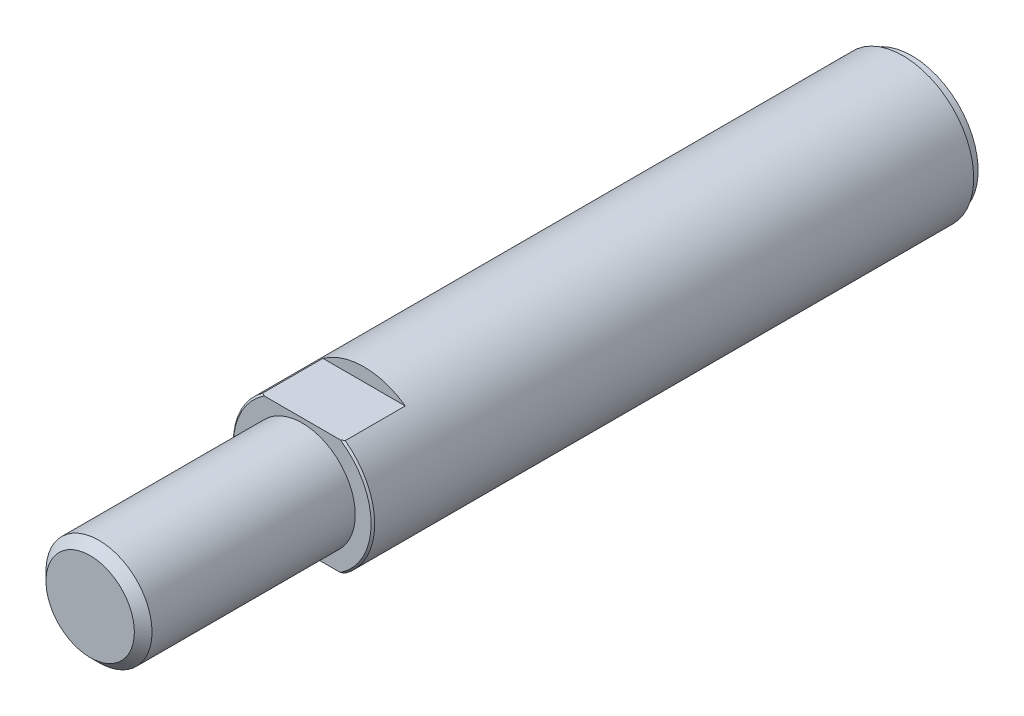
ISO-10303-21;
HEADER;
FILE_DESCRIPTION(('STEP AP214'),'2;1');
FILE_NAME('part.step','',(''),(''),'','','');
FILE_SCHEMA(('AUTOMOTIVE_DESIGN { 1 0 10303 214 1 1 1 1 }'));
ENDSEC;
DATA;
#1=APPLICATION_CONTEXT('core data for automotive mechanical design processes');
#2=APPLICATION_PROTOCOL_DEFINITION('international standard','automotive_design',2000,#1);
#3=PRODUCT_CONTEXT('',#1,'mechanical');
#4=PRODUCT('Part','Part','',(#3));
#5=PRODUCT_RELATED_PRODUCT_CATEGORY('part','',(#4));
#6=PRODUCT_DEFINITION_FORMATION('','',#4);
#7=PRODUCT_DEFINITION_CONTEXT('part definition',#1,'design');
#8=PRODUCT_DEFINITION('design','',#6,#7);
#9=PRODUCT_DEFINITION_SHAPE('','',#8);
#10=(LENGTH_UNIT() NAMED_UNIT(*) SI_UNIT(.MILLI.,.METRE.));
#11=(NAMED_UNIT(*) PLANE_ANGLE_UNIT() SI_UNIT($,.RADIAN.));
#12=(NAMED_UNIT(*) SI_UNIT($,.STERADIAN.) SOLID_ANGLE_UNIT());
#13=UNCERTAINTY_MEASURE_WITH_UNIT(LENGTH_MEASURE(1.E-05),#10,'distance_accuracy_value','');
#14=(GEOMETRIC_REPRESENTATION_CONTEXT(3) GLOBAL_UNCERTAINTY_ASSIGNED_CONTEXT((#13)) GLOBAL_UNIT_ASSIGNED_CONTEXT((#10,
#11,#12)) REPRESENTATION_CONTEXT('',''));
#15=CARTESIAN_POINT('',(0.,0.,0.));
#16=DIRECTION('',(0.,0.,1.));
#17=DIRECTION('',(1.,0.,0.));
#18=AXIS2_PLACEMENT_3D('',#15,#16,#17);
#19=CARTESIAN_POINT('',(0.,0.,93.));
#20=DIRECTION('',(0.,0.,-1.));
#21=DIRECTION('',(-1.,0.,0.));
#22=AXIS2_PLACEMENT_3D('',#19,#20,#21);
#23=CYLINDRICAL_SURFACE('',#22,8.);
#24=DIRECTION('',(0.,0.,-1.));
#25=VECTOR('',#24,1.);
#26=CARTESIAN_POINT('',(-4.66368952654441,-6.5,93.));
#27=LINE('',#26,#25);
#28=CARTESIAN_POINT('',(-4.66368952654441,-6.5,68.8));
#29=VERTEX_POINT('',#28);
#30=CARTESIAN_POINT('',(-4.66368952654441,-6.5,62.));
#31=VERTEX_POINT('',#30);
#32=EDGE_CURVE('E337',#29,#31,#27,.T.);
#33=ORIENTED_EDGE('',*,*,#32,.F.);
#34=CARTESIAN_POINT('',(0.,0.,68.8));
#35=DIRECTION('',(0.,0.,1.));
#36=DIRECTION('',(1.,0.,0.));
#37=AXIS2_PLACEMENT_3D('',#34,#35,#36);
#38=CIRCLE('',#37,8.);
#39=CARTESIAN_POINT('',(-4.66368952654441,6.5,68.8));
#40=VERTEX_POINT('',#39);
#41=EDGE_CURVE('E66',#29,#40,#38,.F.);
#42=ORIENTED_EDGE('',*,*,#41,.T.);
#43=DIRECTION('',(0.,0.,-1.));
#44=VECTOR('',#43,1.);
#45=CARTESIAN_POINT('',(-4.66368952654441,6.5,93.));
#46=LINE('',#45,#44);
#47=CARTESIAN_POINT('',(-4.66368952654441,6.5,62.));
#48=VERTEX_POINT('',#47);
#49=EDGE_CURVE('E106',#48,#40,#46,.F.);
#50=ORIENTED_EDGE('',*,*,#49,.F.);
#51=CARTESIAN_POINT('',(0.,0.,62.));
#52=DIRECTION('',(0.,0.,1.));
#53=DIRECTION('',(1.,0.,0.));
#54=AXIS2_PLACEMENT_3D('',#51,#52,#53);
#55=CIRCLE('',#54,8.);
#56=CARTESIAN_POINT('',(4.66368952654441,6.5,62.));
#57=VERTEX_POINT('',#56);
#58=EDGE_CURVE('E110',#57,#48,#55,.T.);
#59=ORIENTED_EDGE('',*,*,#58,.F.);
#60=DIRECTION('',(0.,0.,-1.));
#61=VECTOR('',#60,1.);
#62=CARTESIAN_POINT('',(4.66368952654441,6.5,93.));
#63=LINE('',#62,#61);
#64=CARTESIAN_POINT('',(4.66368952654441,6.5,68.8));
#65=VERTEX_POINT('',#64);
#66=EDGE_CURVE('E99',#65,#57,#63,.T.);
#67=ORIENTED_EDGE('',*,*,#66,.F.);
#68=CARTESIAN_POINT('',(0.,0.,68.8));
#69=DIRECTION('',(0.,0.,1.));
#70=DIRECTION('',(1.,0.,0.));
#71=AXIS2_PLACEMENT_3D('',#68,#69,#70);
#72=CIRCLE('',#71,8.);
#73=CARTESIAN_POINT('',(4.66368952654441,-6.5,68.8));
#74=VERTEX_POINT('',#73);
#75=EDGE_CURVE('E353',#65,#74,#72,.F.);
#76=ORIENTED_EDGE('',*,*,#75,.T.);
#77=DIRECTION('',(0.,0.,-1.));
#78=VECTOR('',#77,1.);
#79=CARTESIAN_POINT('',(4.66368952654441,-6.5,93.));
#80=LINE('',#79,#78);
#81=CARTESIAN_POINT('',(4.66368952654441,-6.5,62.));
#82=VERTEX_POINT('',#81);
#83=EDGE_CURVE('E105',#82,#74,#80,.F.);
#84=ORIENTED_EDGE('',*,*,#83,.F.);
#85=EDGE_CURVE('E114',#31,#82,#55,.T.);
#86=ORIENTED_EDGE('',*,*,#85,.F.);
#87=EDGE_LOOP('',(#33,#42,#50,#59,#67,#76,#84,#86));
#88=FACE_BOUND('',#87,.T.);
#89=CARTESIAN_POINT('',(0.,0.,1.));
#90=DIRECTION('',(0.,0.,-1.));
#91=DIRECTION('',(-1.,0.,0.));
#92=AXIS2_PLACEMENT_3D('',#89,#90,#91);
#93=CIRCLE('',#92,8.);
#94=CARTESIAN_POINT('',(-8.,0.,1.));
#95=VERTEX_POINT('',#94);
#96=EDGE_CURVE('E46',#95,#95,#93,.T.);
#97=ORIENTED_EDGE('',*,*,#96,.F.);
#98=EDGE_LOOP('',(#97));
#99=FACE_BOUND('',#98,.T.);
#100=ADVANCED_FACE('F42',(#88,#99),#23,.T.);
#101=CARTESIAN_POINT('',(0.,0.,69.));
#102=DIRECTION('',(0.,0.,1.));
#103=DIRECTION('',(1.,0.,0.));
#104=AXIS2_PLACEMENT_3D('',#101,#102,#103);
#105=PLANE('',#104);
#106=CARTESIAN_POINT('',(0.,0.,69.));
#107=DIRECTION('',(0.,0.,1.));
#108=DIRECTION('',(1.,0.,0.));
#109=AXIS2_PLACEMENT_3D('',#106,#107,#108);
#110=CIRCLE('',#109,6.);
#111=CARTESIAN_POINT('',(6.,0.,69.));
#112=VERTEX_POINT('',#111);
#113=EDGE_CURVE('E345',#112,#112,#110,.T.);
#114=ORIENTED_EDGE('',*,*,#113,.F.);
#115=EDGE_LOOP('',(#114));
#116=FACE_BOUND('',#115,.T.);
#117=DIRECTION('',(-1.,0.,0.));
#118=VECTOR('',#117,1.);
#119=CARTESIAN_POINT('',(0.,6.5,69.));
#120=LINE('',#119,#118);
#121=CARTESIAN_POINT('',(4.31161222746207,6.5,69.));
#122=VERTEX_POINT('',#121);
#123=CARTESIAN_POINT('',(-4.31161222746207,6.5,69.));
#124=VERTEX_POINT('',#123);
#125=EDGE_CURVE('E119',#122,#124,#120,.T.);
#126=ORIENTED_EDGE('',*,*,#125,.T.);
#127=CARTESIAN_POINT('',(0.,0.,69.));
#128=DIRECTION('',(0.,0.,1.));
#129=DIRECTION('',(1.,0.,0.));
#130=AXIS2_PLACEMENT_3D('',#127,#128,#129);
#131=CIRCLE('',#130,7.80000000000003);
#132=CARTESIAN_POINT('',(-4.31161222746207,-6.5,69.));
#133=VERTEX_POINT('',#132);
#134=EDGE_CURVE('E125',#124,#133,#131,.T.);
#135=ORIENTED_EDGE('',*,*,#134,.T.);
#136=DIRECTION('',(1.,0.,0.));
#137=VECTOR('',#136,1.);
#138=CARTESIAN_POINT('',(0.,-6.5,69.));
#139=LINE('',#138,#137);
#140=CARTESIAN_POINT('',(4.31161222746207,-6.5,69.));
#141=VERTEX_POINT('',#140);
#142=EDGE_CURVE('E115',#133,#141,#139,.T.);
#143=ORIENTED_EDGE('',*,*,#142,.T.);
#144=CARTESIAN_POINT('',(0.,0.,69.));
#145=DIRECTION('',(0.,0.,1.));
#146=DIRECTION('',(1.,0.,0.));
#147=AXIS2_PLACEMENT_3D('',#144,#145,#146);
#148=CIRCLE('',#147,7.80000000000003);
#149=EDGE_CURVE('E117',#141,#122,#148,.T.);
#150=ORIENTED_EDGE('',*,*,#149,.T.);
#151=EDGE_LOOP('',(#126,#135,#143,#150));
#152=FACE_BOUND('',#151,.T.);
#153=ADVANCED_FACE('F188',(#116,#152),#105,.T.);
#154=CARTESIAN_POINT('',(0.,0.,69.));
#155=DIRECTION('',(0.,0.,1.));
#156=DIRECTION('',(1.,0.,0.));
#157=AXIS2_PLACEMENT_3D('',#154,#155,#156);
#158=CYLINDRICAL_SURFACE('',#157,6.);
#159=CARTESIAN_POINT('',(0.,0.,92.));
#160=DIRECTION('',(0.,0.,1.));
#161=DIRECTION('',(1.,0.,0.));
#162=AXIS2_PLACEMENT_3D('',#159,#160,#161);
#163=CIRCLE('',#162,6.);
#164=CARTESIAN_POINT('',(6.,0.,92.));
#165=VERTEX_POINT('',#164);
#166=EDGE_CURVE('E12',#165,#165,#163,.F.);
#167=ORIENTED_EDGE('',*,*,#166,.T.);
#168=EDGE_LOOP('',(#167));
#169=FACE_BOUND('',#168,.T.);
#170=ORIENTED_EDGE('',*,*,#113,.T.);
#171=EDGE_LOOP('',(#170));
#172=FACE_BOUND('',#171,.T.);
#173=ADVANCED_FACE('F185',(#169,#172),#158,.T.);
#174=CARTESIAN_POINT('',(0.,0.,93.));
#175=DIRECTION('',(0.,0.,1.));
#176=DIRECTION('',(1.,0.,0.));
#177=AXIS2_PLACEMENT_3D('',#174,#175,#176);
#178=PLANE('',#177);
#179=CARTESIAN_POINT('',(0.,0.,93.));
#180=DIRECTION('',(0.,0.,1.));
#181=DIRECTION('',(1.,0.,0.));
#182=AXIS2_PLACEMENT_3D('',#179,#180,#181);
#183=CIRCLE('',#182,4.99999999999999);
#184=CARTESIAN_POINT('',(4.99999999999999,0.,93.));
#185=VERTEX_POINT('',#184);
#186=EDGE_CURVE('E51',#185,#185,#183,.T.);
#187=ORIENTED_EDGE('',*,*,#186,.T.);
#188=EDGE_LOOP('',(#187));
#189=FACE_BOUND('',#188,.T.);
#190=ADVANCED_FACE('F170',(#189),#178,.T.);
#191=CARTESIAN_POINT('',(-13.7678185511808,6.5,62.));
#192=DIRECTION('',(0.,1.,0.));
#193=DIRECTION('',(0.,0.,1.));
#194=AXIS2_PLACEMENT_3D('',#191,#192,#193);
#195=PLANE('',#194);
#196=ORIENTED_EDGE('',*,*,#49,.T.);
#197=CARTESIAN_POINT('',(-4.66368952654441,6.5,68.8));
#198=CARTESIAN_POINT('',(-4.60539036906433,6.5,68.8340029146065));
#199=CARTESIAN_POINT('',(-4.5469010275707,6.5,68.8676710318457));
#200=CARTESIAN_POINT('',(-4.4295419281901,6.5,68.9343376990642));
#201=CARTESIAN_POINT('',(-4.37067216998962,6.5,68.9673362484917));
#202=CARTESIAN_POINT('',(-4.31161222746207,6.5,69.));
#203=B_SPLINE_CURVE_WITH_KNOTS('',3,(#197,#198,#199,#200,#201,#202),.UNSPECIFIED.,.F.,.F.,(4,2,
4),(0.,0.202462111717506,0.404924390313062),.UNSPECIFIED.);
#204=EDGE_CURVE('E161',#40,#124,#203,.T.);
#205=ORIENTED_EDGE('',*,*,#204,.T.);
#206=ORIENTED_EDGE('',*,*,#125,.F.);
#207=CARTESIAN_POINT('',(4.31161222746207,6.5,69.));
#208=CARTESIAN_POINT('',(4.37067216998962,6.5,68.9673362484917));
#209=CARTESIAN_POINT('',(4.4295419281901,6.5,68.9343376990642));
#210=CARTESIAN_POINT('',(4.5469010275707,6.5,68.8676710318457));
#211=CARTESIAN_POINT('',(4.60539036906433,6.5,68.8340029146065));
#212=CARTESIAN_POINT('',(4.66368952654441,6.5,68.8));
#213=B_SPLINE_CURVE_WITH_KNOTS('',3,(#207,#208,#209,#210,#211,#212),.UNSPECIFIED.,.F.,.F.,(4,2,
4),(0.,0.202462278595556,0.404924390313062),.UNSPECIFIED.);
#214=EDGE_CURVE('E58',#122,#65,#213,.T.);
#215=ORIENTED_EDGE('',*,*,#214,.T.);
#216=ORIENTED_EDGE('',*,*,#66,.T.);
#217=DIRECTION('',(-1.,0.,0.));
#218=VECTOR('',#217,1.);
#219=CARTESIAN_POINT('',(-13.7678185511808,6.5,62.));
#220=LINE('',#219,#218);
#221=EDGE_CURVE('E102',#57,#48,#220,.T.);
#222=ORIENTED_EDGE('',*,*,#221,.T.);
#223=EDGE_LOOP('',(#196,#205,#206,#215,#216,#222));
#224=FACE_BOUND('',#223,.T.);
#225=ADVANCED_FACE('F101',(#224),#195,.T.);
#226=CARTESIAN_POINT('',(0.,0.,62.));
#227=DIRECTION('',(0.,0.,1.));
#228=DIRECTION('',(1.,0.,0.));
#229=AXIS2_PLACEMENT_3D('',#226,#227,#228);
#230=PLANE('',#229);
#231=ORIENTED_EDGE('',*,*,#58,.T.);
#232=ORIENTED_EDGE('',*,*,#221,.F.);
#233=EDGE_LOOP('',(#231,#232));
#234=FACE_BOUND('',#233,.T.);
#235=ADVANCED_FACE('F109',(#234),#230,.T.);
#236=ORIENTED_EDGE('',*,*,#85,.T.);
#237=DIRECTION('',(1.,0.,0.));
#238=VECTOR('',#237,1.);
#239=CARTESIAN_POINT('',(-13.7678185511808,-6.5,62.));
#240=LINE('',#239,#238);
#241=EDGE_CURVE('E111',#31,#82,#240,.T.);
#242=ORIENTED_EDGE('',*,*,#241,.F.);
#243=EDGE_LOOP('',(#236,#242));
#244=FACE_BOUND('',#243,.T.);
#245=ADVANCED_FACE('F174',(#244),#230,.T.);
#246=CARTESIAN_POINT('',(-13.7678185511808,-6.5,62.));
#247=DIRECTION('',(0.,-1.,0.));
#248=DIRECTION('',(0.,0.,-1.));
#249=AXIS2_PLACEMENT_3D('',#246,#247,#248);
#250=PLANE('',#249);
#251=ORIENTED_EDGE('',*,*,#142,.F.);
#252=CARTESIAN_POINT('',(-4.31161222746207,-6.5,69.));
#253=CARTESIAN_POINT('',(-4.37067216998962,-6.5,68.9673362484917));
#254=CARTESIAN_POINT('',(-4.4295419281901,-6.5,68.9343376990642));
#255=CARTESIAN_POINT('',(-4.5469010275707,-6.5,68.8676710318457));
#256=CARTESIAN_POINT('',(-4.60539036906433,-6.5,68.8340029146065));
#257=CARTESIAN_POINT('',(-4.66368952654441,-6.5,68.8));
#258=B_SPLINE_CURVE_WITH_KNOTS('',3,(#252,#253,#254,#255,#256,#257),.UNSPECIFIED.,.F.,.F.,(4,2,
4),(0.,0.202462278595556,0.404924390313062),.UNSPECIFIED.);
#259=EDGE_CURVE('E135',#133,#29,#258,.T.);
#260=ORIENTED_EDGE('',*,*,#259,.T.);
#261=ORIENTED_EDGE('',*,*,#32,.T.);
#262=ORIENTED_EDGE('',*,*,#241,.T.);
#263=ORIENTED_EDGE('',*,*,#83,.T.);
#264=CARTESIAN_POINT('',(4.66368952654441,-6.5,68.8));
#265=CARTESIAN_POINT('',(4.60539036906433,-6.5,68.8340029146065));
#266=CARTESIAN_POINT('',(4.5469010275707,-6.5,68.8676710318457));
#267=CARTESIAN_POINT('',(4.4295419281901,-6.5,68.9343376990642));
#268=CARTESIAN_POINT('',(4.37067216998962,-6.5,68.9673362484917));
#269=CARTESIAN_POINT('',(4.31161222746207,-6.5,69.));
#270=B_SPLINE_CURVE_WITH_KNOTS('',3,(#264,#265,#266,#267,#268,#269),.UNSPECIFIED.,.F.,.F.,(4,2,
4),(0.,0.202462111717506,0.404924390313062),.UNSPECIFIED.);
#271=EDGE_CURVE('E128',#74,#141,#270,.T.);
#272=ORIENTED_EDGE('',*,*,#271,.T.);
#273=EDGE_LOOP('',(#251,#260,#261,#262,#263,#272));
#274=FACE_BOUND('',#273,.T.);
#275=ADVANCED_FACE('F142',(#274),#250,.T.);
#276=CARTESIAN_POINT('',(0.,0.,69.));
#277=DIRECTION('',(0.,0.,-1.));
#278=DIRECTION('',(-1.,0.,0.));
#279=AXIS2_PLACEMENT_3D('',#276,#277,#278);
#280=CONICAL_SURFACE('',#279,7.80000000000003,0.785398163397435);
#281=ORIENTED_EDGE('',*,*,#204,.F.);
#282=ORIENTED_EDGE('',*,*,#41,.F.);
#283=ORIENTED_EDGE('',*,*,#259,.F.);
#284=ORIENTED_EDGE('',*,*,#134,.F.);
#285=EDGE_LOOP('',(#281,#282,#283,#284));
#286=FACE_BOUND('',#285,.T.);
#287=ADVANCED_FACE('F149',(#286),#280,.T.);
#288=CARTESIAN_POINT('',(0.,0.,69.));
#289=DIRECTION('',(0.,0.,-1.));
#290=DIRECTION('',(-1.,0.,0.));
#291=AXIS2_PLACEMENT_3D('',#288,#289,#290);
#292=CONICAL_SURFACE('',#291,7.80000000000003,0.785398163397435);
#293=ORIENTED_EDGE('',*,*,#271,.F.);
#294=ORIENTED_EDGE('',*,*,#75,.F.);
#295=ORIENTED_EDGE('',*,*,#214,.F.);
#296=ORIENTED_EDGE('',*,*,#149,.F.);
#297=EDGE_LOOP('',(#293,#294,#295,#296));
#298=FACE_BOUND('',#297,.T.);
#299=ADVANCED_FACE('F146',(#298),#292,.T.);
#300=CARTESIAN_POINT('',(0.,0.,93.));
#301=DIRECTION('',(0.,0.,-1.));
#302=DIRECTION('',(-1.,0.,0.));
#303=AXIS2_PLACEMENT_3D('',#300,#301,#302);
#304=CONICAL_SURFACE('',#303,4.99999999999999,0.785398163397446);
#305=ORIENTED_EDGE('',*,*,#166,.F.);
#306=EDGE_LOOP('',(#305));
#307=FACE_BOUND('',#306,.T.);
#308=ORIENTED_EDGE('',*,*,#186,.F.);
#309=EDGE_LOOP('',(#308));
#310=FACE_BOUND('',#309,.T.);
#311=ADVANCED_FACE('F44',(#307,#310),#304,.T.);
#312=CARTESIAN_POINT('',(0.,0.,1.));
#313=DIRECTION('',(0.,0.,-1.));
#314=DIRECTION('',(-1.,0.,0.));
#315=AXIS2_PLACEMENT_3D('',#312,#313,#314);
#316=PLANE('',#315);
#317=CARTESIAN_POINT('',(0.,0.,1.));
#318=DIRECTION('',(0.,0.,-1.));
#319=DIRECTION('',(-1.,0.,0.));
#320=AXIS2_PLACEMENT_3D('',#317,#318,#319);
#321=CIRCLE('',#320,7.5);
#322=CARTESIAN_POINT('',(-7.5,0.,1.));
#323=VERTEX_POINT('',#322);
#324=EDGE_CURVE('E324',#323,#323,#321,.T.);
#325=ORIENTED_EDGE('',*,*,#324,.F.);
#326=EDGE_LOOP('',(#325));
#327=FACE_BOUND('',#326,.T.);
#328=ORIENTED_EDGE('',*,*,#96,.T.);
#329=EDGE_LOOP('',(#328));
#330=FACE_BOUND('',#329,.T.);
#331=ADVANCED_FACE('F251',(#327,#330),#316,.T.);
#332=CARTESIAN_POINT('',(0.,0.,1.));
#333=DIRECTION('',(0.,0.,-1.));
#334=DIRECTION('',(-1.,0.,0.));
#335=AXIS2_PLACEMENT_3D('',#332,#333,#334);
#336=CYLINDRICAL_SURFACE('',#335,7.5);
#337=ORIENTED_EDGE('',*,*,#324,.T.);
#338=EDGE_LOOP('',(#337));
#339=FACE_BOUND('',#338,.T.);
#340=CARTESIAN_POINT('',(0.,0.,0.));
#341=DIRECTION('',(0.,0.,-1.));
#342=DIRECTION('',(-1.,0.,0.));
#343=AXIS2_PLACEMENT_3D('',#340,#341,#342);
#344=CIRCLE('',#343,7.5);
#345=CARTESIAN_POINT('',(-7.5,0.,0.));
#346=VERTEX_POINT('',#345);
#347=EDGE_CURVE('E327',#346,#346,#344,.T.);
#348=ORIENTED_EDGE('',*,*,#347,.F.);
#349=EDGE_LOOP('',(#348));
#350=FACE_BOUND('',#349,.T.);
#351=ADVANCED_FACE('F183',(#339,#350),#336,.T.);
#352=CARTESIAN_POINT('',(0.,0.,22.25));
#353=DIRECTION('',(0.,0.,-1.));
#354=DIRECTION('',(-1.,0.,0.));
#355=AXIS2_PLACEMENT_3D('',#352,#353,#354);
#356=CONICAL_SURFACE('',#355,3.4,1.02974425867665);
#357=CARTESIAN_POINT('',(0.,0.,24.2929261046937));
#358=VERTEX_POINT('',#357);
#359=VERTEX_LOOP('',#358);
#360=FACE_BOUND('',#359,.T.);
#361=CARTESIAN_POINT('',(0.,0.,22.25));
#362=DIRECTION('',(0.,0.,-1.));
#363=DIRECTION('',(-1.,0.,0.));
#364=AXIS2_PLACEMENT_3D('',#361,#362,#363);
#365=CIRCLE('',#364,3.4);
#366=CARTESIAN_POINT('',(-3.4,0.,22.25));
#367=VERTEX_POINT('',#366);
#368=EDGE_CURVE('E342',#367,#367,#365,.T.);
#369=ORIENTED_EDGE('',*,*,#368,.T.);
#370=EDGE_LOOP('',(#369));
#371=FACE_BOUND('',#370,.T.);
#372=ADVANCED_FACE('F179',(#360,#371),#356,.F.);
#373=CARTESIAN_POINT('',(0.,0.,0.));
#374=DIRECTION('',(0.,0.,-1.));
#375=DIRECTION('',(-1.,0.,0.));
#376=AXIS2_PLACEMENT_3D('',#373,#374,#375);
#377=CYLINDRICAL_SURFACE('',#376,3.4);
#378=ORIENTED_EDGE('',*,*,#368,.F.);
#379=EDGE_LOOP('',(#378));
#380=FACE_BOUND('',#379,.T.);
#381=CARTESIAN_POINT('',(0.,0.,0.));
#382=DIRECTION('',(0.,0.,-1.));
#383=DIRECTION('',(-1.,0.,0.));
#384=AXIS2_PLACEMENT_3D('',#381,#382,#383);
#385=CIRCLE('',#384,3.4);
#386=CARTESIAN_POINT('',(-3.4,0.,0.));
#387=VERTEX_POINT('',#386);
#388=EDGE_CURVE('E339',#387,#387,#385,.T.);
#389=ORIENTED_EDGE('',*,*,#388,.T.);
#390=EDGE_LOOP('',(#389));
#391=FACE_BOUND('',#390,.T.);
#392=ADVANCED_FACE('F175',(#380,#391),#377,.F.);
#393=CARTESIAN_POINT('',(0.,0.,0.));
#394=DIRECTION('',(0.,0.,1.));
#395=DIRECTION('',(1.,0.,0.));
#396=AXIS2_PLACEMENT_3D('',#393,#394,#395);
#397=PLANE('',#396);
#398=ORIENTED_EDGE('',*,*,#388,.F.);
#399=EDGE_LOOP('',(#398));
#400=FACE_BOUND('',#399,.T.);
#401=ORIENTED_EDGE('',*,*,#347,.T.);
#402=EDGE_LOOP('',(#401));
#403=FACE_BOUND('',#402,.T.);
#404=ADVANCED_FACE('F178',(#400,#403),#397,.F.);
#405=CLOSED_SHELL('',(#100,#153,#173,#190,#225,#235,#245,#275,#287,#299,#311,#331,#351,#372,
#392,#404));
#406=MANIFOLD_SOLID_BREP('B2',#405);
#407=ADVANCED_BREP_SHAPE_REPRESENTATION('',(#18,#406),#14);
#408=SHAPE_DEFINITION_REPRESENTATION(#9,#407);
ENDSEC;
END-ISO-10303-21;
